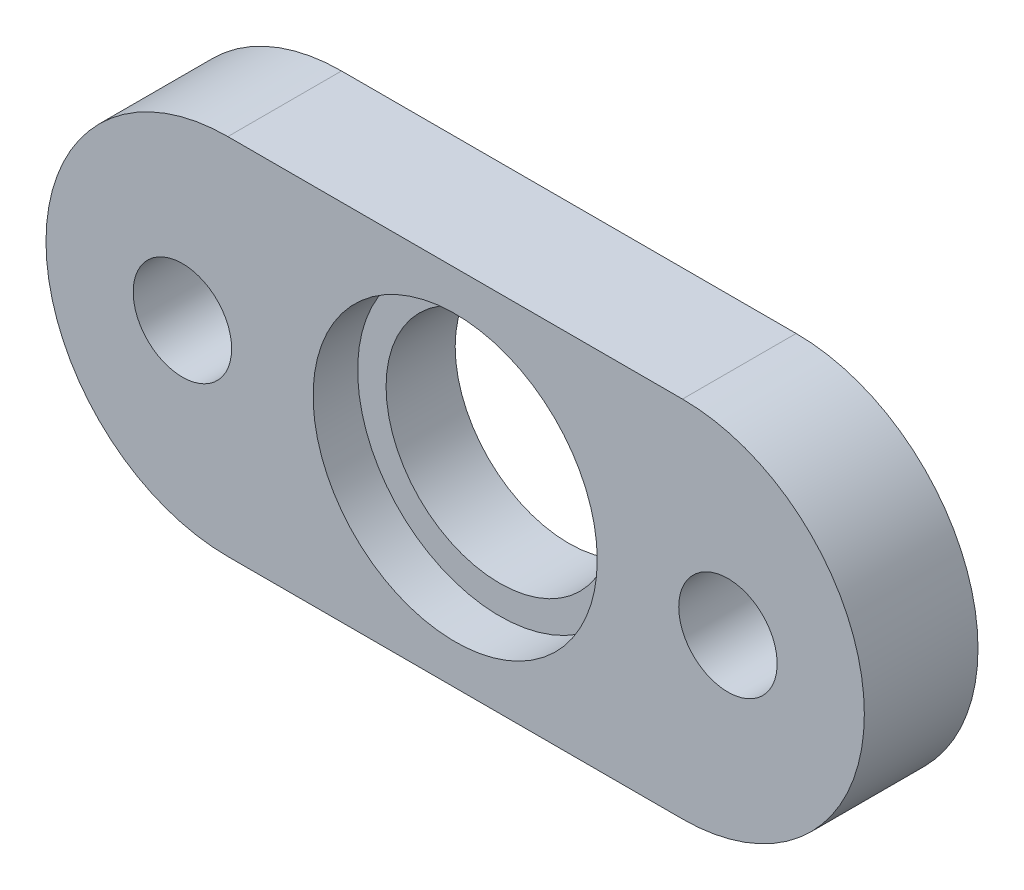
from build123d import *

# Parameters (mm, degrees)
BOSS_EXTRUDE5_DEPTH = 6.35
SKETCH5_R           = 7.9375
CUT_EXTRUDE3_DEPTH  = 2.4892
SKETCH6_R           = 6.35
SKETCH6_R_2         = 2.75
CUT_EXTRUDE4_DEPTH  = 26.80944982


with BuildPart() as part:
    # Sketch2 → Boss-Extrude5 (new body)
    with BuildSketch(Plane.XY):
        with BuildLine():
            Line((-12.7, 10.16), (12.7, 10.16))
            ThreePointArc((12.7, 10.16), (22.86, 0), (12.7, -10.16))
            Line((12.7, -10.16), (-12.7, -10.16))
            ThreePointArc((-12.7, -10.16), (-22.86, 0), (-12.7, 10.16))
        make_face()
    extrude(amount=BOSS_EXTRUDE5_DEPTH)

    # Sketch5 → Cut-Extrude3 (cut)
    with BuildSketch(Plane.XY.offset(6.35)):
        Circle(SKETCH5_R)
    extrude(amount=-CUT_EXTRUDE3_DEPTH, mode=Mode.SUBTRACT)

    # Sketch6 → Cut-Extrude4 (cut, through all)
    with BuildSketch(Plane.XY.offset(6.35)):
        Circle(SKETCH6_R)
        with Locations((-15.24, 0)):
            Circle(SKETCH6_R_2)
        with Locations(Location((15.24, 0, 0), (0, 0, 180))):
            Circle(SKETCH6_R_2)
    extrude(amount=-CUT_EXTRUDE4_DEPTH, mode=Mode.SUBTRACT)


solid = part.part
